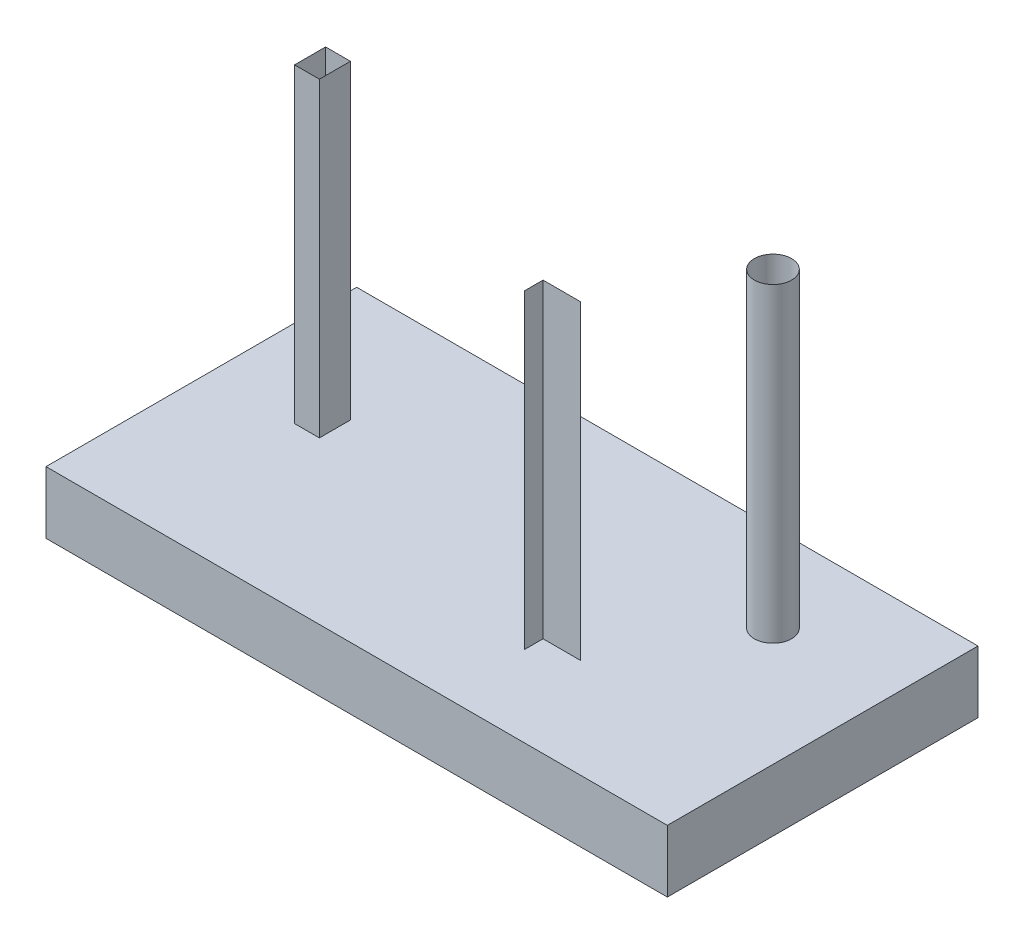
from build123d import *

# Parameters (mm, degrees)
SKETCH1_W      = 100
SKETCH1_H      = 50
EXTRUDE1_DEPTH = 10


with BuildPart() as part:
    # Sketch1 → Extrude1 (new body)
    with BuildSketch(Plane(origin=(0, 0, 0), x_dir=(1, 0, 0), z_dir=(0, 1, 0))):
        with Locations((50, 25)):
            Rectangle(SKETCH1_W, SKETCH1_H)
    extrude(amount=EXTRUDE1_DEPTH)


solid = part.part
